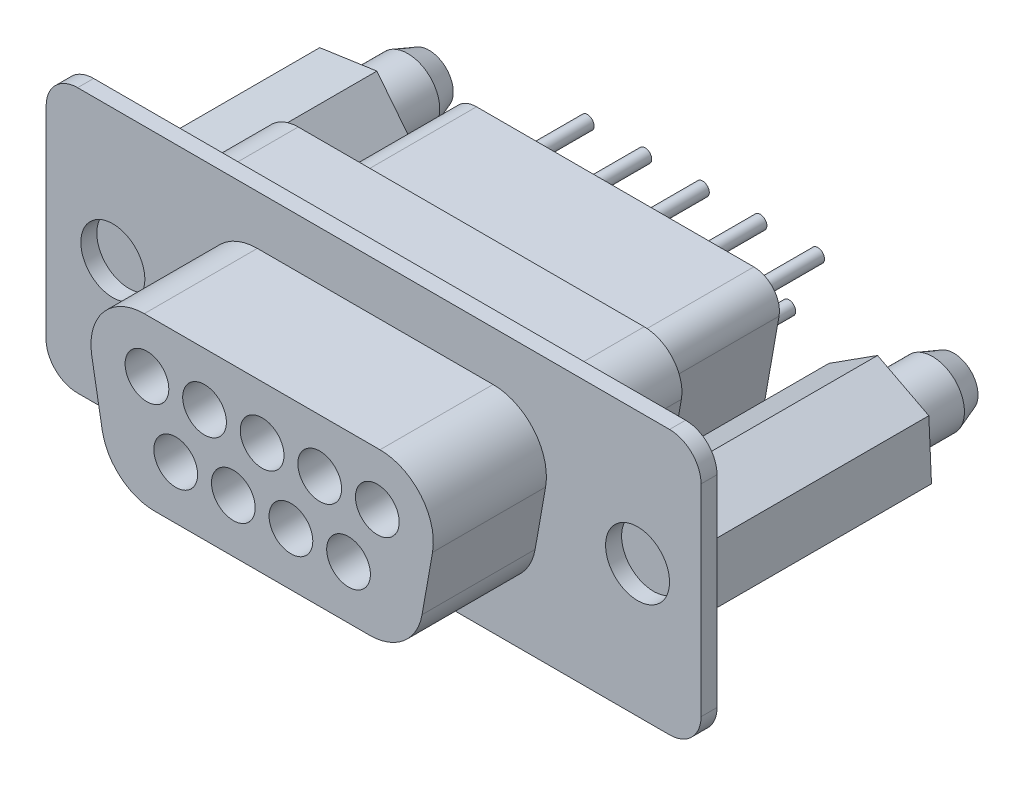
from build123d import *
from OCP.BRepFilletAPI import BRepFilletAPI_MakeChamfer

# Parameters (mm, degrees)
SKETCH1_R           = 1.0414
BASE_EXTRUDE_DEPTH  = 6.1468
SKETCH2_R           = 1.524
BOSS_EXTRUDE1_DEPTH = 0.762
BOSS_EXTRUDE2_DEPTH = 3.81
BOSS_EXTRUDE3_DEPTH = 6.858
SKETCH7_R           = 0.3175
BOSS_EXTRUDE4_DEPTH = 4.1656
BOSS_EXTRUDE5_DEPTH = 10.795
BOSS_EXTRUDE6_START = 3.5052
SKETCH9_R           = 1.524
BOSS_EXTRUDE6_DEPTH = 3.5052
CHAMFER1_SIZE       = 1.016
CHAMFER1_SIZE2      = 0.369793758


with BuildPart() as part:
    # Sketch1 → Base-Extrude (new body)
    with BuildSketch(Plane.XY):
        with BuildLine():
            Line((8.114811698, -0.45376634), (7.617675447, -3.27316633))
            ThreePointArc((7.617675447, -3.27316633), (6.748944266, -4.777852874), (5.116263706, -5.3721))
            Line((5.116263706, -5.3721), (-5.116263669, -5.3721))
            ThreePointArc((-5.116263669, -5.3721), (-6.748944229, -4.777852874), (-7.617675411, -3.27316633))
            Line((-7.617675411, -3.27316633), (-8.114811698, -0.45376634))
            ThreePointArc((-8.114811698, -0.45376634), (-7.559152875, 1.619980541), (-5.6134, 2.5273))
            Line((-5.6134, 2.5273), (5.6134, 2.5273))
            ThreePointArc((5.6134, 2.5273), (7.559152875, 1.619980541), (8.114811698, -0.45376634))
        make_face()
        with Locations((5.4864, 0)):
            Circle(SKETCH1_R, mode=Mode.SUBTRACT)
        with Locations((2.7432, 0)):
            Circle(SKETCH1_R, mode=Mode.SUBTRACT)
        Circle(SKETCH1_R, mode=Mode.SUBTRACT)
        with Locations((-2.7432, 0)):
            Circle(SKETCH1_R, mode=Mode.SUBTRACT)
        with Locations((-5.4864, 0)):
            Circle(SKETCH1_R, mode=Mode.SUBTRACT)
        with Locations((-4.1148, -2.8448)):
            Circle(SKETCH1_R, mode=Mode.SUBTRACT)
        with Locations((-1.3716, -2.8448)):
            Circle(SKETCH1_R, mode=Mode.SUBTRACT)
        with Locations((1.3716, -2.8448)):
            Circle(SKETCH1_R, mode=Mode.SUBTRACT)
        with Locations((4.1148, -2.8448)):
            Circle(SKETCH1_R, mode=Mode.SUBTRACT)
    extrude(amount=BASE_EXTRUDE_DEPTH)

    # Sketch2 → Boss-Extrude1 (add)
    with BuildSketch(Plane(origin=(7.968862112, 1.58821288, 0), x_dir=(-1, 0, 0), z_dir=(0, 0, -1))):
        with BuildLine():
            Line((23.640662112, 1.78998712), (23.640662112, -7.65881288))
            ThreePointArc((23.640662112, -7.65881288), (23.262078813, -8.815557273), (22.149831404, -9.30981288))
            Line((22.149831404, -9.30981288), (-6.051937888, -9.30981288))
            ThreePointArc((-6.051937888, -9.30981288), (-7.111608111, -8.870883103), (-7.550537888, -7.81121288))
            Line((-7.550537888, -7.81121288), (-7.550537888, 1.78998712))
            ThreePointArc((-7.550537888, 1.78998712), (-7.111608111, 2.849657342), (-6.051937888, 3.28858712))
            Line((-6.051937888, 3.28858712), (22.142062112, 3.28858712))
            ThreePointArc((22.142062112, 3.28858712), (23.201732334, 2.849657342), (23.640662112, 1.78998712))
        make_face()
        with Locations((20.465662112, -3.01061288)):
            Circle(SKETCH2_R, mode=Mode.SUBTRACT)
        with Locations((-4.527937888, -3.01061288)):
            Circle(SKETCH2_R, mode=Mode.SUBTRACT)
    extrude(amount=-BOSS_EXTRUDE1_DEPTH)

    # Sketch3 → Boss-Extrude2 (add)
    with BuildSketch(Plane(origin=(4.148961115, -0.24842271, 0), x_dir=(-1, 0, 0), z_dir=(0, 0, -1))):
        with BuildLine():
            Line((-4.090132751, 4.18542271), (12.38805498, 4.18542271))
            ThreePointArc((12.38805498, 4.18542271), (13.765613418, 3.543056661), (14.159009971, 2.074880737))
            Line((14.159009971, 2.074880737), (12.922164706, -4.939617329))
            ThreePointArc((12.922164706, -4.939617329), (12.254110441, -6.096721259), (10.998579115, -6.55369729))
            Line((10.998579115, -6.55369729), (-2.700656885, -6.55369729))
            ThreePointArc((-2.700656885, -6.55369729), (-3.956188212, -6.096721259), (-4.624242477, -4.939617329))
            Line((-4.624242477, -4.939617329), (-5.861087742, 2.074880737))
            ThreePointArc((-5.861087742, 2.074880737), (-5.467691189, 3.543056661), (-4.090132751, 4.18542271))
        make_face()
    extrude(amount=BOSS_EXTRUDE2_DEPTH)

    # Sketch6 → Boss-Extrude3 (add)
    with BuildSketch(Plane(origin=(15.473991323, -0.06781082, -3.81), x_dir=(-1, 0, 0), z_dir=(0, 0, -1))):
        with BuildLine():
            Line((23.278668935, 0.795898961), (22.445629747, -3.928501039))
            ThreePointArc((22.445629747, -3.928501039), (22.028638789, -4.650750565), (21.244952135, -4.93598918))
            Line((21.244952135, -4.93598918), (9.708191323, -4.93598918))
            ThreePointArc((9.708191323, -4.93598918), (8.924999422, -4.651165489), (8.507738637, -3.929772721))
            Line((8.507738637, -3.929772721), (7.669538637, 0.794627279))
            ThreePointArc((7.669538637, 0.794627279), (7.935615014, 1.79080272), (8.869991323, 2.22681082))
            Line((8.869991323, 2.22681082), (22.077991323, 2.22681082))
            ThreePointArc((22.077991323, 2.22681082), (23.011952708, 1.791297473), (23.278668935, 0.795898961))
        make_face()
    extrude(amount=BOSS_EXTRUDE3_DEPTH)

    # Sketch7 → Boss-Extrude4 (add)
    with BuildSketch(Plane(origin=(0, 0, -10.668), x_dir=(-1, 0, 0), z_dir=(0, 0, -1))):
        with Locations(Location((5.4864, 0, 0), (0, 0, 180))):
            Circle(SKETCH7_R)
        with Locations(Location((2.7432, 0, 0), (0, 0, 180))):
            Circle(SKETCH7_R)
        with Locations(Location((0, 0, 0), (0, 0, 180))):
            Circle(SKETCH7_R)
        with Locations(Location((-2.7432, 0, 0), (0, 0, 180))):
            Circle(SKETCH7_R)
        with Locations(Location((-5.4864, 0, 0), (0, 0, 180))):
            Circle(SKETCH7_R)
        with Locations(Location((-4.1148, -2.8448, 0), (0, 0, 180))):
            Circle(SKETCH7_R)
        with Locations(Location((-1.3716, -2.8448, 0), (0, 0, 180))):
            Circle(SKETCH7_R)
        with Locations(Location((1.3716, -2.8448, 0), (0, 0, 180))):
            Circle(SKETCH7_R)
        with Locations(Location((4.1148, -2.8448, 0), (0, 0, 180))):
            Circle(SKETCH7_R)
    extrude(amount=BOSS_EXTRUDE4_DEPTH)

    # Sketch8 → Boss-Extrude5 (add)
    with BuildSketch(Plane(origin=(0, 0, 0), x_dir=(-1, 0, 0), z_dir=(0, 0, -1))):
        Polygon((13.516740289, -3.97586638), (15.218136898, -1.815838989), (14.198196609, 0.737627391), (11.476859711, 1.13106638), (9.775463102, -1.028961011), (10.795403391, -3.582427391), align=None)
        Polygon((-12.623677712, -4.169101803), (-10.181525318, -2.905630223), (-10.054647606, -0.15892842), (-12.369922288, 1.324301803), (-14.812074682, 0.060830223), (-14.938952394, -2.68587158), align=None)
    extrude(amount=BOSS_EXTRUDE5_DEPTH)

    # Sketch9 → Boss-Extrude6 (add)
    with BuildSketch(Plane(origin=(0, 0, -10.795), x_dir=(-1, 0, 0), z_dir=(0, 0, -1)).offset(BOSS_EXTRUDE6_START)):
        with Locations((12.4968, -1.4224)):
            Circle(SKETCH9_R)
        with Locations((-12.4968, -1.4224)):
            Circle(SKETCH9_R)
    extrude(amount=-BOSS_EXTRUDE6_DEPTH)

    # Chamfer1: one chamfer whose edges measure the first distance from different faces: ONE call of the kernel's chamfer builder (chamfer() names one face for all edges)
    chamfer1_edges_1 = [part.edges().sort_by_distance(p)[0] for p in [
        (-10.9728, -1.4224, -14.3002),
    ]]
    chamfer1_side_1 = [part.faces().sort_by_distance(p)[0] for p in [
        (-10.9728, -1.4224, -12.5476),
    ]]
    chamfer1_edges_2 = [part.edges().sort_by_distance(p)[0] for p in [
        (14.0208, -1.4224, -14.3002),
    ]]
    chamfer1_side_2 = [part.faces().sort_by_distance(p)[0] for p in [
        (14.0208, -1.4224, -12.5476),
    ]]
    chamfer1 = BRepFilletAPI_MakeChamfer(part.part.solid().wrapped)
    for e in chamfer1_edges_1:
        chamfer1.Add(CHAMFER1_SIZE, CHAMFER1_SIZE2, e.wrapped, chamfer1_side_1[0].wrapped)  # the first distance lies on this face
    for e in chamfer1_edges_2:
        chamfer1.Add(CHAMFER1_SIZE, CHAMFER1_SIZE2, e.wrapped, chamfer1_side_2[0].wrapped)  # the first distance lies on this face
    add(Compound.cast(chamfer1.Shape()), mode=Mode.REPLACE)


solid = part.part
